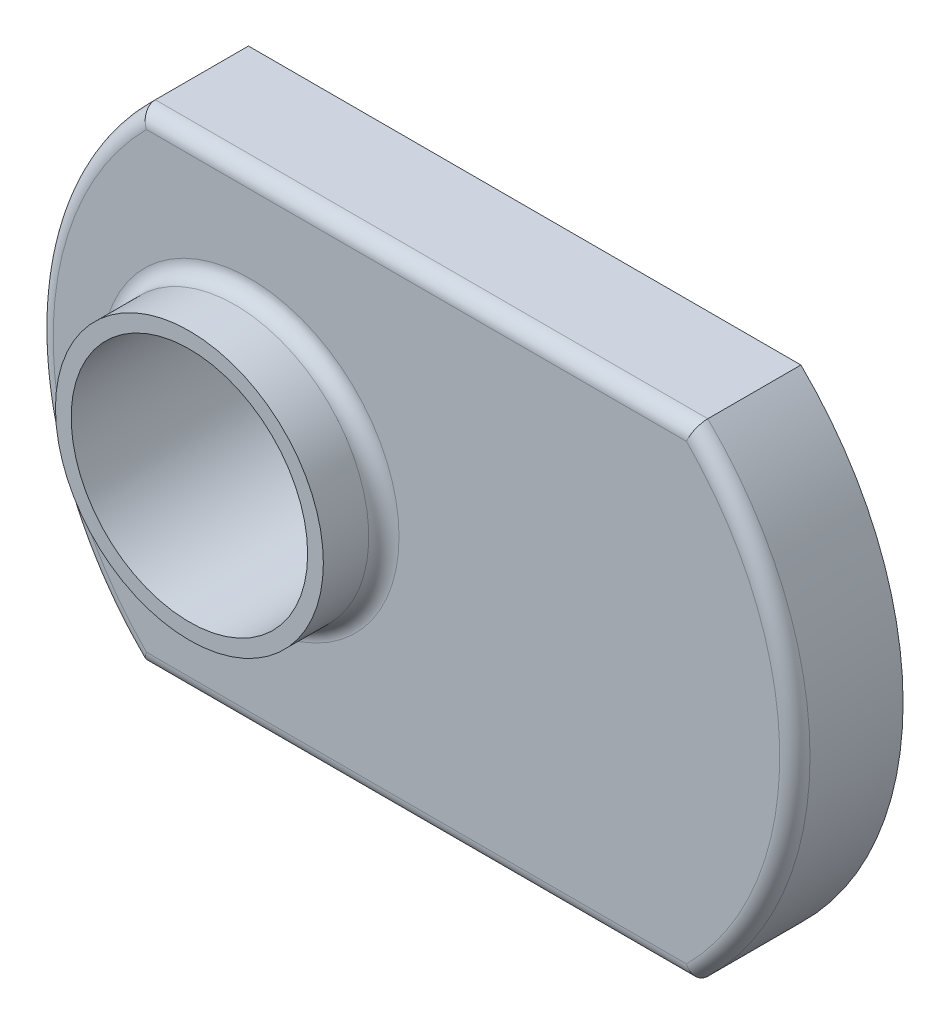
from build123d import *

# Parameters (mm, degrees)
SKETCH1_W                          = 25.4
SKETCH1_H                          = 16.2052
BASE_EXTRUDE_DEPTH                 = 3.6322
SKETCH2_R                          = 4.4958
BOSS_EXTRUDE1_DEPTH                = 2.032
F_5_16_18_TAPPED_HOLE1_D           = 6.5278
F_5_16_18_TAPPED_HOLE1_CBORE_D     = 7.9375
F_5_16_18_TAPPED_HOLE1_CBORE_DEPTH = 15.875
CUT_EXTRUDE1_DEPTH                 = 31.347345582
CUT_EXTRUDE1_DEPTH_BACK            = 31.347345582
CUT_EXTRUDE2_DEPTH                 = 31.347345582
CUT_EXTRUDE2_DEPTH_BACK            = 31.347345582
FILLET1_R                          = 0.508


with BuildPart() as part:
    # Sketch1 → Base-Extrude (new body)
    with BuildSketch(Plane.XY):
        with Locations((12.7, 8.1026)):
            Rectangle(SKETCH1_W, SKETCH1_H)
    extrude(amount=-BASE_EXTRUDE_DEPTH)

    # Sketch2 → Boss-Extrude1 (add)
    with BuildSketch(Plane.XY):
        with Locations(Location((7.112, 8.1026, 0), (0, 0, 180))):
            Circle(SKETCH2_R)
    extrude(amount=BOSS_EXTRUDE1_DEPTH)

    # 5_16-18 Tapped Hole1 (through all)
    with Locations(Plane(origin=(7.112, 8.1026, 2.032), x_dir=(1, 0, 0), z_dir=(0, 0, 1))):
        with Locations((0, 0)):
            CounterBoreHole(F_5_16_18_TAPPED_HOLE1_D / 2, F_5_16_18_TAPPED_HOLE1_CBORE_D / 2, F_5_16_18_TAPPED_HOLE1_CBORE_DEPTH)

    # Sketch4 → Cut-Extrude1 (cut, two sides: drawn at the far end of the back side and taken through both)
    with BuildSketch(Plane.XY.offset(-CUT_EXTRUDE1_DEPTH_BACK)):
        with BuildLine():
            Line((-24.402199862, 61.181765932), (21.971, 16.2052))
            ThreePointArc((21.971, 16.2052), (25.4, 8.1026), (21.971, 0))
            Line((21.971, 0), (-24.402199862, -44.976565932))
            Line((-24.402199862, -44.976565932), (104.800975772, -44.976565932))
            Line((104.800975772, -44.976565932), (104.800975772, 61.181765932))
            Line((104.800975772, 61.181765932), (-24.402199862, 61.181765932))
        make_face()
    extrude(amount=CUT_EXTRUDE1_DEPTH + CUT_EXTRUDE1_DEPTH_BACK, mode=Mode.SUBTRACT)

    # Sketch6 → Cut-Extrude2 (cut, two sides: drawn at the far end of the back side and taken through both)
    with BuildSketch(Plane.XY.offset(-CUT_EXTRUDE2_DEPTH_BACK)):
        with BuildLine():
            Line((49.802199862, 61.181765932), (3.429, 16.2052))
            ThreePointArc((3.429, 16.2052), (0, 8.1026), (3.429, 0))
            Line((3.429, 0), (49.802199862, -44.976565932))
            Line((49.802199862, -44.976565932), (-79.400975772, -44.976565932))
            Line((-79.400975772, -44.976565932), (-79.400975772, 61.181765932))
            Line((-79.400975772, 61.181765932), (49.802199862, 61.181765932))
        make_face()
    extrude(amount=CUT_EXTRUDE2_DEPTH + CUT_EXTRUDE2_DEPTH_BACK, mode=Mode.SUBTRACT)

    # Fillet1
    fillet1_edges = [part.edges().sort_by_distance(p)[0] for p in [
        (12.7, 0, 0),
        (0, 8.1026, 0),
        (12.7, 16.2052, 0),
        (11.6078, 8.1026, 0),
        (25.4, 8.1026, 0),
    ]]
    fillet(fillet1_edges, radius=FILLET1_R)


solid = part.part
